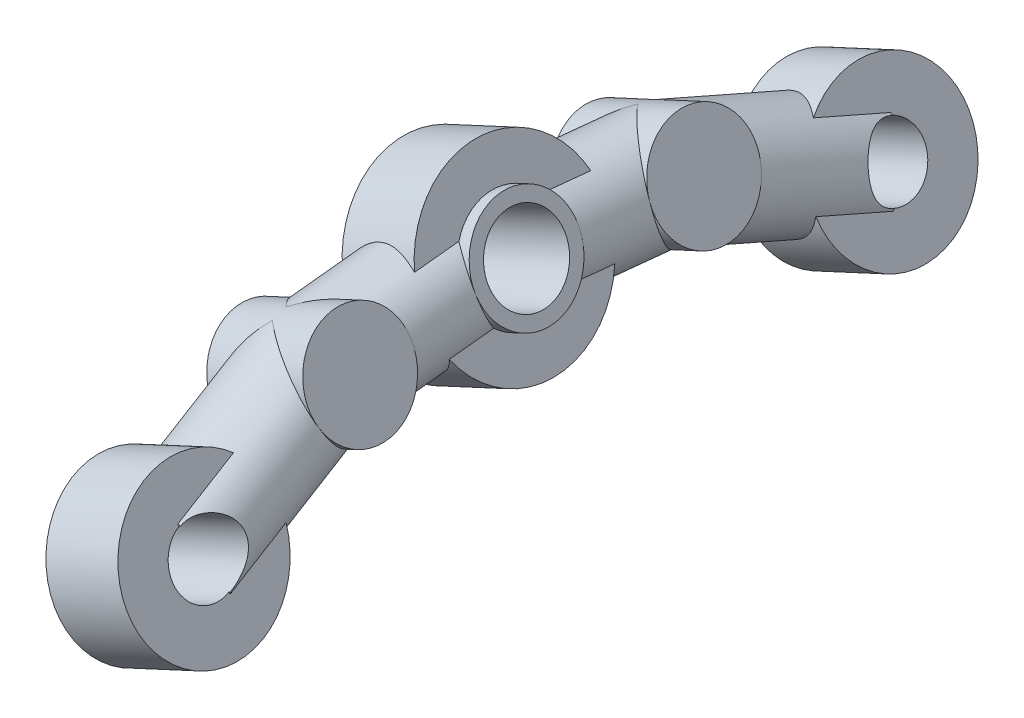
from build123d import *

# Parameters (mm, degrees)
ARCO_1_PROFILE_R           = 4
ARCO_2_PROFILE_R           = 4
ARCO_3_PROFILE_R           = 4
ARCO_4_PROFILE_R           = 4
ARCO_CODO_1_PROFILE_R      = 4
ARCO_CODO_2_PROFILE_R      = 4
ARCO_CODO_3_PROFILE_R      = 4
BOSS_IZQ_PROFILE_R         = 6
BOSS_DCHO_PROFILE_R        = 6
BOSS_CENTRO_PROFILE_R      = 7
PIVOTE_IZQ_PROFILE_R       = 2.5
PIVOTE_DCHO_PROFILE_R      = 2.5
TALADRO_TORNILLO_PROFILE_R = 3


with BuildPart() as part:
    # Arco_1: sweep along a curve in space
    with BuildLine() as arco_1_path:
        Line((430.95553860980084, 383.6551995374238, -26), (428.85069684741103, 388.1905761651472, -13))
    # Arco_1 profile (on start of the path) → Arco_1 (sweep)
    with BuildSketch(Plane(origin=(430.95553860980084, 383.6551995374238, -26), x_dir=(0, 0.9441890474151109, -0.3294040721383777), z_dir=(-0.15111883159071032, 0.3256210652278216, 0.9333456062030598))):
        Circle(ARCO_1_PROFILE_R)
    sweep(path=arco_1_path.line)

    # Arco_2: sweep along a curve in space
    with BuildLine() as arco_2_path:
        Line((428.85069684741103, 388.1905761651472, -13), (428.42972849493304, 389.0976514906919, 0))
    # Arco_2 profile (on start of the path) → Arco_2 (sweep)
    with BuildSketch(Plane(origin=(428.85069684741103, 388.1905761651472, -13), x_dir=(0, 0.9975745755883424, -0.06960579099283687), z_dir=(-0.032286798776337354, 0.06956950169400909, 0.9970544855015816))):
        Circle(ARCO_2_PROFILE_R)
    sweep(path=arco_2_path.line)

    # Arco_3: sweep along a curve in space
    with BuildLine() as arco_3_path:
        Line((428.42972849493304, 389.0976514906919, 0), (428.85069684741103, 388.1905761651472, 13))
    # Arco_3 profile (on start of the path) → Arco_3 (sweep)
    with BuildSketch(Plane(origin=(428.42972849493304, 389.0976514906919, 0), x_dir=(0, 0.9975745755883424, 0.06960579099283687), z_dir=(0.032286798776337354, -0.06956950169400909, 0.9970544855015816))):
        Circle(ARCO_3_PROFILE_R)
    sweep(path=arco_3_path.line)

    # Arco_4: sweep along a curve in space
    with BuildLine() as arco_4_path:
        Line((428.85069684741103, 388.1905761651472, 13), (430.95553860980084, 383.6551995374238, 26))
    # Arco_4 profile (on start of the path) → Arco_4 (sweep)
    with BuildSketch(Plane(origin=(428.85069684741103, 388.1905761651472, 13), x_dir=(0, 0.9441890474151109, 0.3294040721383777), z_dir=(0.15111883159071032, -0.3256210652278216, 0.9333456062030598))):
        Circle(ARCO_4_PROFILE_R)
    sweep(path=arco_4_path.line)

    # Arco_codo_1: sweep along a curve in space
    with BuildLine() as arco_codo_1_path:
        Line((425.2223955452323, 386.5067027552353, -13), (432.4789981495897, 389.8744495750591, -13))
    # Arco_codo_1 profile (on start of the path) → Arco_codo_1 (sweep)
    with BuildSketch(Plane(origin=(425.2223955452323, 386.5067027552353, -13), x_dir=(-0.4209683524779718, 0.9070753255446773, 0), z_dir=(0.9070753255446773, 0.4209683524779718, 0))):
        Circle(ARCO_CODO_1_PROFILE_R)
    sweep(path=arco_codo_1_path.line)

    # Arco_codo_2: sweep along a curve in space
    with BuildLine() as arco_codo_2_path:
        Line((424.8014271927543, 387.41377808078, 0), (432.0580297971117, 390.78152490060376, 0))
    # Arco_codo_2 profile (on start of the path) → Arco_codo_2 (sweep)
    with BuildSketch(Plane(origin=(424.8014271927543, 387.41377808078, 0), x_dir=(-0.4209683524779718, 0.9070753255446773, 0), z_dir=(0.9070753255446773, 0.4209683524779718, 0))):
        Circle(ARCO_CODO_2_PROFILE_R)
    sweep(path=arco_codo_2_path.line)

    # Arco_codo_3: sweep along a curve in space
    with BuildLine() as arco_codo_3_path:
        Line((425.2223955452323, 386.5067027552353, 13), (432.4789981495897, 389.8744495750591, 13))
    # Arco_codo_3 profile (on start of the path) → Arco_codo_3 (sweep)
    with BuildSketch(Plane(origin=(425.2223955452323, 386.5067027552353, 13), x_dir=(-0.4209683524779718, 0.9070753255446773, 0), z_dir=(0.9070753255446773, 0.4209683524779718, 0))):
        Circle(ARCO_CODO_3_PROFILE_R)
    sweep(path=arco_codo_3_path.line)

    # Boss_izq: sweep along a curve in space
    with BuildLine() as boss_izq_path:
        Line((428.2343126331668, 382.3922944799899, -26), (433.67676458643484, 384.9181045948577, -26))
    # Boss_izq profile (on start of the path) → Boss_izq (sweep)
    with BuildSketch(Plane(origin=(428.2343126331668, 382.3922944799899, -26), x_dir=(-0.420968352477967, 0.9070753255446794, 0), z_dir=(0.9070753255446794, 0.420968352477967, 0))):
        Circle(BOSS_IZQ_PROFILE_R)
    sweep(path=boss_izq_path.line)

    # Boss_dcho: sweep along a curve in space
    with BuildLine() as boss_dcho_path:
        Line((428.2343126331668, 382.3922944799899, 26), (433.67676458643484, 384.9181045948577, 26))
    # Boss_dcho profile (on start of the path) → Boss_dcho (sweep)
    with BuildSketch(Plane(origin=(428.2343126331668, 382.3922944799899, 26), x_dir=(-0.420968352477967, 0.9070753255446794, 0), z_dir=(0.9070753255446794, 0.420968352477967, 0))):
        Circle(BOSS_DCHO_PROFILE_R)
    sweep(path=boss_dcho_path.line)

    # Boss_centro: sweep along a curve in space
    with BuildLine() as boss_centro_path:
        Line((425.708502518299, 387.834746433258, 0), (431.15095447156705, 390.36055654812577, 0))
    # Boss_centro profile (on start of the path) → Boss_centro (sweep)
    with BuildSketch(Plane(origin=(425.708502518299, 387.834746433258, 0), x_dir=(-0.420968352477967, 0.9070753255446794, 0), z_dir=(0.9070753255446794, 0.420968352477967, 0))):
        Circle(BOSS_CENTRO_PROFILE_R)
    sweep(path=boss_centro_path.line)

    # Pivote_izq: sweep along a curve in space
    with BuildLine() as pivote_izq_path:
        Line((427.3272373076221, 381.97132612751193, -26), (434.5838399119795, 385.3390729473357, -26))
    # Pivote_izq profile (on start of the path) → Pivote_izq (sweep, cut)
    with BuildSketch(Plane(origin=(427.3272373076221, 381.97132612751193, -26), x_dir=(-0.4209683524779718, 0.9070753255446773, 0), z_dir=(0.9070753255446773, 0.4209683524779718, 0))):
        Circle(PIVOTE_IZQ_PROFILE_R)
    sweep(path=pivote_izq_path.line, mode=Mode.SUBTRACT)

    # Pivote_dcho: sweep along a curve in space
    with BuildLine() as pivote_dcho_path:
        Line((427.3272373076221, 381.97132612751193, 26), (434.5838399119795, 385.3390729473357, 26))
    # Pivote_dcho profile (on start of the path) → Pivote_dcho (sweep, cut)
    with BuildSketch(Plane(origin=(427.3272373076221, 381.97132612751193, 26), x_dir=(-0.4209683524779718, 0.9070753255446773, 0), z_dir=(0.9070753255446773, 0.4209683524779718, 0))):
        Circle(PIVOTE_DCHO_PROFILE_R)
    sweep(path=pivote_dcho_path.line, mode=Mode.SUBTRACT)

    # Taladro_tornillo: sweep along a curve in space
    with BuildLine() as taladro_tornillo_path:
        Line((424.8014271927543, 387.41377808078, 0), (432.0580297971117, 390.78152490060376, 0))
    # Taladro_tornillo profile (on start of the path) → Taladro_tornillo (sweep, cut)
    with BuildSketch(Plane(origin=(424.8014271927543, 387.41377808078, 0), x_dir=(-0.4209683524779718, 0.9070753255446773, 0), z_dir=(0.9070753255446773, 0.4209683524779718, 0))):
        Circle(TALADRO_TORNILLO_PROFILE_R)
    sweep(path=taladro_tornillo_path.line, mode=Mode.SUBTRACT)


solid = part.part
